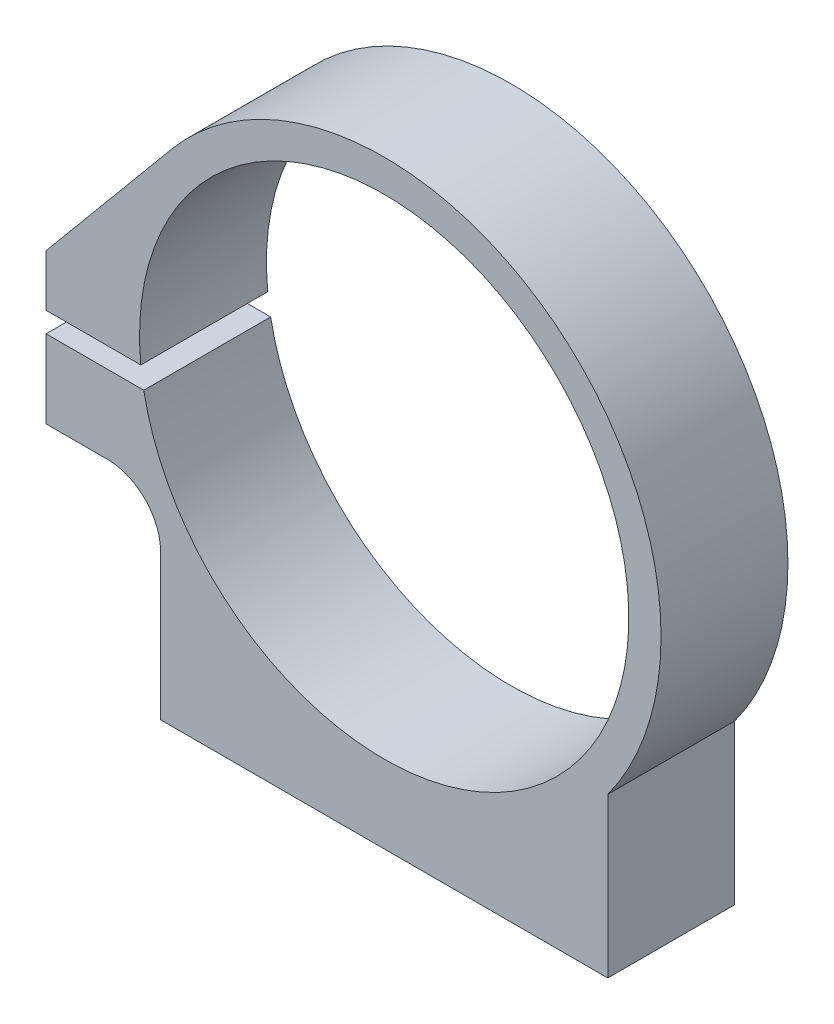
from build123d import *

# Parameters (mm, degrees)
BOSS_EXTRUDE1_DEPTH = 9.4996
SKETCH2_R           = 1.47955
CUT_EXTRUDE1_DEPTH  = 6.35


with BuildPart() as part:
    # Sketch1 → Boss-Extrude1 (new body)
    with BuildSketch(Plane.XY.offset(60.330889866)):
        with BuildLine():
            Line((16.7386, -12.223049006), (16.7386, -24.13))
            Line((16.7386, -24.13), (-16.7386, -24.13))
            Line((-16.7386, -24.13), (-16.7386, -13.214349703))
            ThreePointArc((-16.7386, -13.214349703), (-17.904739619, -10.399039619), (-20.720049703, -9.2329))
            Line((-20.720049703, -9.2329), (-25.3111, -9.2329))
            Line((-25.3111, -9.2329), (-25.3111, -3.3909))
            Line((-25.3111, -3.3909), (-17.996733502, -3.3909))
            ThreePointArc((-17.996733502, -3.3909), (18.123390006, 2.631226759), (-18.217993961, -1.8669))
            Line((-18.217993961, -1.8669), (-25.3111, -1.8669))
            Line((-25.3111, -1.8669), (-25.3111, 1.9939))
            Line((-25.3111, 1.9939), (-15.927354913, 13.262843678))
            ThreePointArc((-15.927354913, 13.262843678), (12.749400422, 16.341249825), (16.7386, -12.223049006))
        make_face()
    extrude(amount=-BOSS_EXTRUDE1_DEPTH)

    # Sketch2 → Cut-Extrude1 (cut)
    with BuildSketch(Plane.XZ.offset(24.13)):
        with Locations(Location((-13.55725, 55.581089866, 0), (0, 0, 270))):
            Circle(SKETCH2_R)
        with Locations(Location((13.55725, 55.581089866, 0), (0, 0, 270))):
            Circle(SKETCH2_R)
    extrude(amount=-CUT_EXTRUDE1_DEPTH, mode=Mode.SUBTRACT)


solid = part.part
